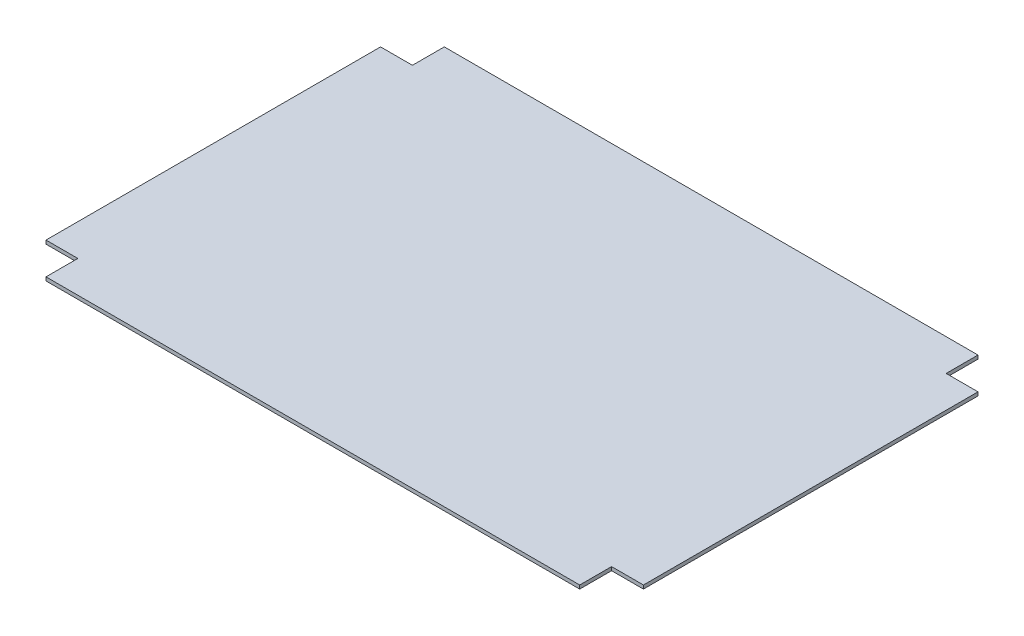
from build123d import *

# Parameters (mm, degrees)
BOSS_EXTRUDE1_DEPTH = 9


with BuildPart() as part:
    # Sketch1 → Boss-Extrude1 (new body)
    with BuildSketch(Plane(origin=(0, 0, 0), x_dir=(1, 0, 0), z_dir=(0, 1, 0))):
        Polygon((-670, 535), (-670, 455), (-750, 455), (-750, -385), (-670, -385), (-670, -465), (670, -465), (670, -385), (750, -385), (750, 455), (670, 455), (670, 535), align=None)
    extrude(amount=BOSS_EXTRUDE1_DEPTH)


solid = part.part
